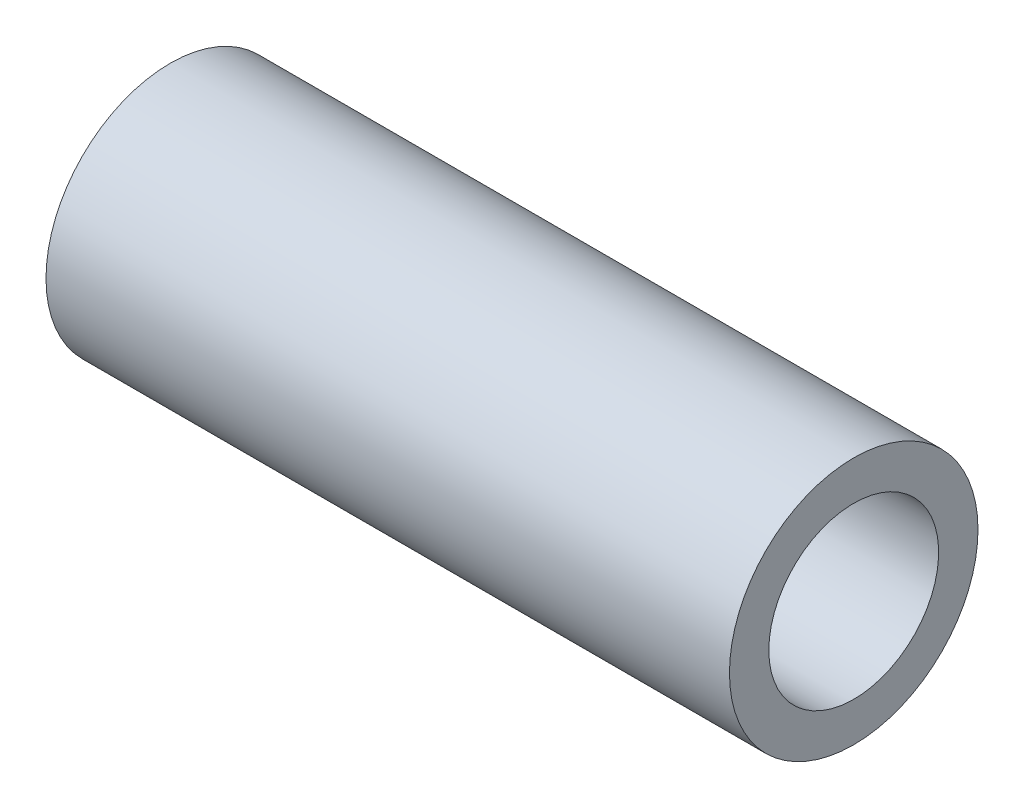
ISO-10303-21;
HEADER;
FILE_DESCRIPTION(('STEP AP214'),'2;1');
FILE_NAME('part.step','',(''),(''),'','','');
FILE_SCHEMA(('AUTOMOTIVE_DESIGN { 1 0 10303 214 1 1 1 1 }'));
ENDSEC;
DATA;
#1=APPLICATION_CONTEXT('core data for automotive mechanical design processes');
#2=APPLICATION_PROTOCOL_DEFINITION('international standard','automotive_design',2000,#1);
#3=PRODUCT_CONTEXT('',#1,'mechanical');
#4=PRODUCT('Part','Part','',(#3));
#5=PRODUCT_RELATED_PRODUCT_CATEGORY('part','',(#4));
#6=PRODUCT_DEFINITION_FORMATION('','',#4);
#7=PRODUCT_DEFINITION_CONTEXT('part definition',#1,'design');
#8=PRODUCT_DEFINITION('design','',#6,#7);
#9=PRODUCT_DEFINITION_SHAPE('','',#8);
#10=(LENGTH_UNIT() NAMED_UNIT(*) SI_UNIT(.MILLI.,.METRE.));
#11=(NAMED_UNIT(*) PLANE_ANGLE_UNIT() SI_UNIT($,.RADIAN.));
#12=(NAMED_UNIT(*) SI_UNIT($,.STERADIAN.) SOLID_ANGLE_UNIT());
#13=UNCERTAINTY_MEASURE_WITH_UNIT(LENGTH_MEASURE(1.E-05),#10,'distance_accuracy_value','');
#14=(GEOMETRIC_REPRESENTATION_CONTEXT(3) GLOBAL_UNCERTAINTY_ASSIGNED_CONTEXT((#13)) GLOBAL_UNIT_ASSIGNED_CONTEXT((#10,
#11,#12)) REPRESENTATION_CONTEXT('',''));
#15=CARTESIAN_POINT('',(0.,0.,0.));
#16=DIRECTION('',(0.,0.,1.));
#17=DIRECTION('',(1.,0.,0.));
#18=AXIS2_PLACEMENT_3D('',#15,#16,#17);
#19=CARTESIAN_POINT('',(16.5,380.,2.));
#20=DIRECTION('',(-1.,0.,0.));
#21=DIRECTION('',(0.,0.,1.));
#22=AXIS2_PLACEMENT_3D('',#19,#20,#21);
#23=CYLINDRICAL_SURFACE('',#22,6.00000000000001);
#24=CARTESIAN_POINT('',(16.5,380.,2.));
#25=DIRECTION('',(-1.,0.,0.));
#26=DIRECTION('',(0.,0.,1.));
#27=AXIS2_PLACEMENT_3D('',#24,#25,#26);
#28=CIRCLE('',#27,6.00000000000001);
#29=CARTESIAN_POINT('',(16.5,380.,8.00000000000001));
#30=VERTEX_POINT('',#29);
#31=EDGE_CURVE('E10',#30,#30,#28,.T.);
#32=ORIENTED_EDGE('',*,*,#31,.T.);
#33=EDGE_LOOP('',(#32));
#34=FACE_BOUND('',#33,.T.);
#35=CARTESIAN_POINT('',(-16.5,380.,2.));
#36=DIRECTION('',(-1.,0.,0.));
#37=DIRECTION('',(0.,0.,1.));
#38=AXIS2_PLACEMENT_3D('',#35,#36,#37);
#39=CIRCLE('',#38,6.00000000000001);
#40=CARTESIAN_POINT('',(-16.5,380.,8.00000000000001));
#41=VERTEX_POINT('',#40);
#42=EDGE_CURVE('E38',#41,#41,#39,.T.);
#43=ORIENTED_EDGE('',*,*,#42,.F.);
#44=EDGE_LOOP('',(#43));
#45=FACE_BOUND('',#44,.T.);
#46=ADVANCED_FACE('F32',(#34,#45),#23,.T.);
#47=CARTESIAN_POINT('',(16.5,380.,2.));
#48=DIRECTION('',(-1.,0.,0.));
#49=DIRECTION('',(0.,0.,1.));
#50=AXIS2_PLACEMENT_3D('',#47,#48,#49);
#51=PLANE('',#50);
#52=CARTESIAN_POINT('',(16.5,380.,2.));
#53=DIRECTION('',(-1.,0.,0.));
#54=DIRECTION('',(0.,0.,1.));
#55=AXIS2_PLACEMENT_3D('',#52,#53,#54);
#56=CIRCLE('',#55,4.09999999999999);
#57=CARTESIAN_POINT('',(16.5,380.,6.09999999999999));
#58=VERTEX_POINT('',#57);
#59=EDGE_CURVE('E42',#58,#58,#56,.T.);
#60=ORIENTED_EDGE('',*,*,#59,.T.);
#61=EDGE_LOOP('',(#60));
#62=FACE_BOUND('',#61,.T.);
#63=ORIENTED_EDGE('',*,*,#31,.F.);
#64=EDGE_LOOP('',(#63));
#65=FACE_BOUND('',#64,.T.);
#66=ADVANCED_FACE('F56',(#62,#65),#51,.F.);
#67=CARTESIAN_POINT('',(-16.5,380.,2.));
#68=DIRECTION('',(-1.,0.,0.));
#69=DIRECTION('',(0.,0.,1.));
#70=AXIS2_PLACEMENT_3D('',#67,#68,#69);
#71=PLANE('',#70);
#72=CARTESIAN_POINT('',(-16.5,380.,2.));
#73=DIRECTION('',(-1.,0.,0.));
#74=DIRECTION('',(0.,0.,1.));
#75=AXIS2_PLACEMENT_3D('',#72,#73,#74);
#76=CIRCLE('',#75,4.09999999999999);
#77=CARTESIAN_POINT('',(-16.5,380.,6.09999999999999));
#78=VERTEX_POINT('',#77);
#79=EDGE_CURVE('E46',#78,#78,#76,.T.);
#80=ORIENTED_EDGE('',*,*,#79,.F.);
#81=EDGE_LOOP('',(#80));
#82=FACE_BOUND('',#81,.T.);
#83=ORIENTED_EDGE('',*,*,#42,.T.);
#84=EDGE_LOOP('',(#83));
#85=FACE_BOUND('',#84,.T.);
#86=ADVANCED_FACE('F54',(#82,#85),#71,.T.);
#87=CARTESIAN_POINT('',(16.5,380.,2.));
#88=DIRECTION('',(-1.,0.,0.));
#89=DIRECTION('',(0.,0.,1.));
#90=AXIS2_PLACEMENT_3D('',#87,#88,#89);
#91=CYLINDRICAL_SURFACE('',#90,4.09999999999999);
#92=ORIENTED_EDGE('',*,*,#59,.F.);
#93=EDGE_LOOP('',(#92));
#94=FACE_BOUND('',#93,.T.);
#95=ORIENTED_EDGE('',*,*,#79,.T.);
#96=EDGE_LOOP('',(#95));
#97=FACE_BOUND('',#96,.T.);
#98=ADVANCED_FACE('F52',(#94,#97),#91,.F.);
#99=CLOSED_SHELL('',(#46,#66,#86,#98));
#100=MANIFOLD_SOLID_BREP('B2',#99);
#101=ADVANCED_BREP_SHAPE_REPRESENTATION('',(#18,#100),#14);
#102=SHAPE_DEFINITION_REPRESENTATION(#9,#101);
ENDSEC;
END-ISO-10303-21;
